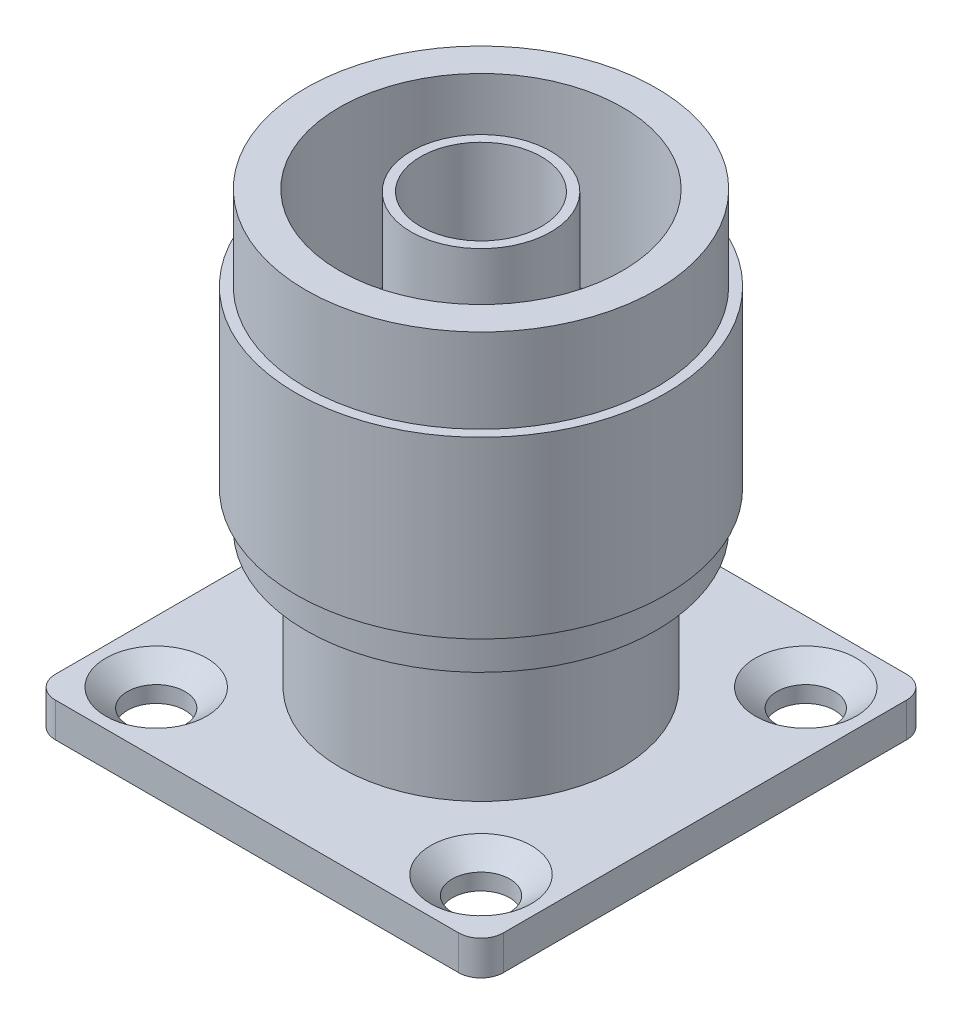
from build123d import *

# Parameters (mm, degrees)
SKETCH1_W                                 = 25.4
SKETCH1_H                                 = 25.4
BOSS_EXTRUDE1_DEPTH                       = 1.9558
SKETCH2_R                                 = 1.59004
SKETCH2_R_2                               = 1.5875
CUT_EXTRUDE1_DEPTH                        = 1.9558
FILLET1_R                                 = 1.27
SKETCH3_R                                 = 7.9375
BOSS_EXTRUDE2_DEPTH                       = 7.747
SKETCH4_R                                 = 9.9314
BOSS_EXTRUDE3_DEPTH                       = 2.032
SKETCH5_R                                 = 10.4902
BOSS_EXTRUDE4_DEPTH                       = 9.906
SKETCH6_R                                 = 9.9314
BOSS_EXTRUDE5_DEPTH                       = 4.7752
SKETCH7_R                                 = 8.0264
CUT_EXTRUDE2_DEPTH                        = 9.779
SKETCH9_R                                 = 3.9624
BOSS_EXTRUDE7_DEPTH                       = 9.652
SKETCH10_R                                = 3.429
CUT_EXTRUDE3_DEPTH                        = 9.652
SKETCH12_R                                = 6.0198
BOSS_EXTRUDE8_DEPTH                       = 0.254
SKETCH13_R                                = 5.08
CUT_EXTRUDE5_DEPTH                        = 0.254
SKETCH14_R                                = 1.651
CUT_EXTRUDE6_DEPTH                        = 32.943466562
CSK_FOR_4_FLAT_HEAD_MACHINE_SCREW_2_COUNT = 2
CSK_FOR_4_FLAT_HEAD_MACHINE_SCREW_2_PITCH = 18.415
CSK_FOR_4_FLAT_HEAD_MACHINE_SCREW_3_COUNT = 2
CSK_FOR_4_FLAT_HEAD_MACHINE_SCREW_3_PITCH = 26.042742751
CSK_FOR_4_FLAT_HEAD_MACHINE_SCREW_4_COUNT = 2
CSK_FOR_4_FLAT_HEAD_MACHINE_SCREW_4_PITCH = 18.415


with BuildPart() as part:
    # Sketch1 → Boss-Extrude1 (new body)
    with BuildSketch(Plane(origin=(0, 0, 0), x_dir=(1, 0, 0), z_dir=(0, 1, 0))):
        Rectangle(SKETCH1_W, SKETCH1_H)
    extrude(amount=BOSS_EXTRUDE1_DEPTH)

    # Sketch2 → Cut-Extrude1 (cut)
    with BuildSketch(Plane(origin=(0, 1.9558, 0), x_dir=(1, 0, 0), z_dir=(0, 1, 0))):
        with Locations(Location((-9.2075, 9.2075, 0), (0, 0, 270))):
            Circle(SKETCH2_R)
        with Locations(Location((9.2075, 9.2075, 0), (0, 0, 270))):
            Circle(SKETCH2_R_2)
        with Locations(Location((9.2075, -9.2075, 0), (0, 0, 270))):
            Circle(SKETCH2_R_2)
        with Locations(Location((-9.2075, -9.2075, 0), (0, 0, 270))):
            Circle(SKETCH2_R_2)
    extrude(amount=-CUT_EXTRUDE1_DEPTH, mode=Mode.SUBTRACT)

    # Fillet1
    fillet1_edges = [part.edges().sort_by_distance(p)[0] for p in [
        (12.7, 0.9779, 12.7),
        (-12.7, 0.9779, 12.7),
        (-12.7, 0.9779, -12.7),
        (12.7, 0.9779, -12.7),
    ]]
    fillet(fillet1_edges, radius=FILLET1_R)

    # Sketch3 → Boss-Extrude2 (add)
    with BuildSketch(Plane(origin=(0, 1.9558, 0), x_dir=(1, 0, 0), z_dir=(0, 1, 0))):
        with Locations(Location((0, 0, 0), (0, 0, 270))):
            Circle(SKETCH3_R)
    extrude(amount=BOSS_EXTRUDE2_DEPTH)

    # Sketch4 → Boss-Extrude3 (add)
    with BuildSketch(Plane(origin=(0, 9.7028, 0), x_dir=(1, 0, 0), z_dir=(0, 1, 0))):
        with Locations(Location((0, 0, 0), (0, 0, 270))):
            Circle(SKETCH4_R)
    extrude(amount=BOSS_EXTRUDE3_DEPTH)

    # Sketch5 → Boss-Extrude4 (add)
    with BuildSketch(Plane(origin=(0, 11.7348, 0), x_dir=(1, 0, 0), z_dir=(0, 1, 0))):
        with Locations(Location((0, 0, 0), (0, 0, 270))):
            Circle(SKETCH5_R)
    extrude(amount=BOSS_EXTRUDE4_DEPTH)

    # Sketch6 → Boss-Extrude5 (add)
    with BuildSketch(Plane(origin=(0, 21.6408, 0), x_dir=(1, 0, 0), z_dir=(0, 1, 0))):
        with Locations(Location((0, 0, 0), (0, 0, 270))):
            Circle(SKETCH6_R)
    extrude(amount=BOSS_EXTRUDE5_DEPTH)

    # Sketch7 → Cut-Extrude2 (cut)
    with BuildSketch(Plane(origin=(0, 26.416, 0), x_dir=(1, 0, 0), z_dir=(0, 1, 0))):
        with Locations(Location((0, 0, 0), (0, 0, 270))):
            Circle(SKETCH7_R)
    extrude(amount=-CUT_EXTRUDE2_DEPTH, mode=Mode.SUBTRACT)

    # Sketch9 → Boss-Extrude7 (add)
    with BuildSketch(Plane(origin=(0, 16.637, 0), x_dir=(1, 0, 0), z_dir=(0, 1, 0))):
        with Locations(Location((0, 0, 0), (0, 0, 270))):
            Circle(SKETCH9_R)
    extrude(amount=BOSS_EXTRUDE7_DEPTH)

    # Sketch10 → Cut-Extrude3 (cut)
    with BuildSketch(Plane(origin=(0, 26.289, 0), x_dir=(1, 0, 0), z_dir=(0, 1, 0))):
        with Locations(Location((0, 0, 0), (0, 0, 270))):
            Circle(SKETCH10_R)
    extrude(amount=-CUT_EXTRUDE3_DEPTH, mode=Mode.SUBTRACT)

    # Sketch12 → Boss-Extrude8 (add)
    with BuildSketch(Plane.XZ):
        with Locations(Location((0, 0, 0), (0, 0, 90))):
            Circle(SKETCH12_R)
    extrude(amount=BOSS_EXTRUDE8_DEPTH)

    # Sketch13 → Cut-Extrude5 (cut)
    with BuildSketch(Plane.XZ.offset(0.254)):
        with Locations(Location((0, 0, 0), (0, 0, 270))):
            Circle(SKETCH13_R)
    extrude(amount=-CUT_EXTRUDE5_DEPTH, mode=Mode.SUBTRACT)

    # Sketch14 → Cut-Extrude6 (cut, through all)
    with BuildSketch(Plane.XZ):
        with Locations(Location((0, 0, 0), (0, 0, 270))):
            Circle(SKETCH14_R)
    extrude(amount=-CUT_EXTRUDE6_DEPTH, mode=Mode.SUBTRACT)

    # Sketch16 → CSK for _4 Flat Head Machine Screw _100 (revolve, cut)
    with BuildSketch(Plane(origin=(-9.2075, 1.9558, -9.2075), x_dir=(0, 0, 1), z_dir=(1, 0, 0))):
        Polygon((0, 0), (0, 2.2098), (1.63195, 2.2098), (1.63195, 1.028358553), (2.8575, 0), align=None)
    csk_for_4_flat_head_machine_screw_100 = revolve(axis=Axis((-9.2075, 8.3058, -9.2075), (0, -1, 0)), mode=Mode.SUBTRACT)

    # CSK for _4 Flat Head Machine Screw _ 2: CSK for _4 Flat Head Machine Screw _100 ×2
    with Locations(*[(i * CSK_FOR_4_FLAT_HEAD_MACHINE_SCREW_2_PITCH, 0, 0) for i in range(1, CSK_FOR_4_FLAT_HEAD_MACHINE_SCREW_2_COUNT)]):
        add(csk_for_4_flat_head_machine_screw_100, mode=Mode.SUBTRACT)

    # CSK for _4 Flat Head Machine Screw _ 3: CSK for _4 Flat Head Machine Screw _100 ×2
    with Locations(*[Vector(0.7071067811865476, 0, 0.7071067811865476) * (i * CSK_FOR_4_FLAT_HEAD_MACHINE_SCREW_3_PITCH) for i in range(1, CSK_FOR_4_FLAT_HEAD_MACHINE_SCREW_3_COUNT)]):
        add(csk_for_4_flat_head_machine_screw_100, mode=Mode.SUBTRACT)

    # CSK for _4 Flat Head Machine Screw _ 4: CSK for _4 Flat Head Machine Screw _100 ×2
    with Locations(*[(0, 0, i * CSK_FOR_4_FLAT_HEAD_MACHINE_SCREW_4_PITCH) for i in range(1, CSK_FOR_4_FLAT_HEAD_MACHINE_SCREW_4_COUNT)]):
        add(csk_for_4_flat_head_machine_screw_100, mode=Mode.SUBTRACT)


solid = part.part
